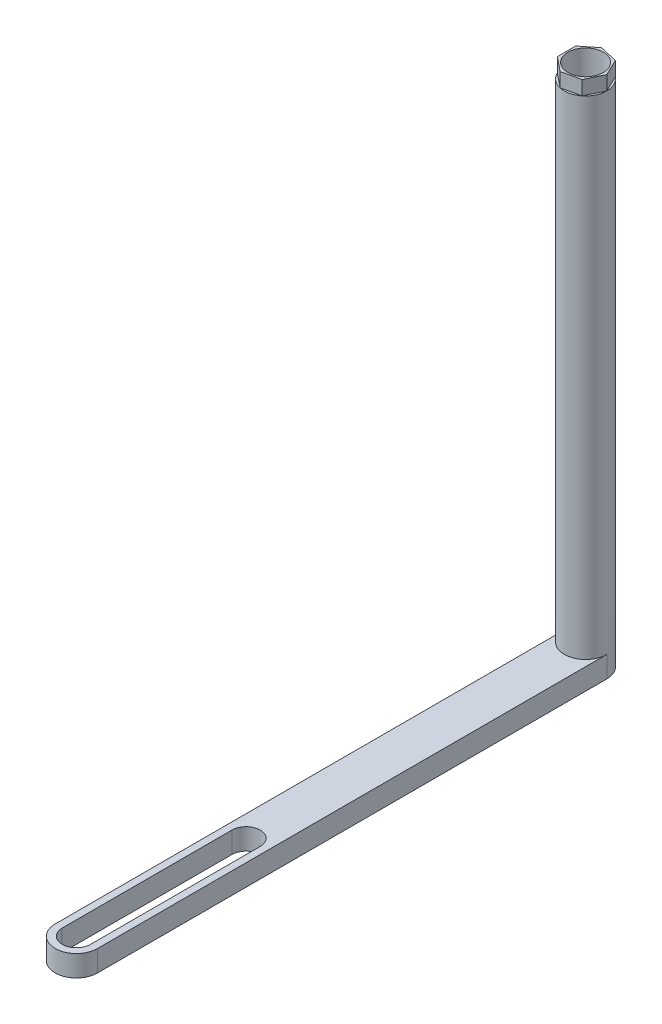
from build123d import *

# Parameters (mm, degrees)
SKETCH1_R           = 1.5
SKETCH1_R_2         = 1.25
BOSS_EXTRUDE1_DEPTH = 37
SKETCH2_R           = 1.25
BOSS_EXTRUDE2_DEPTH = 1.5
CUT_EXTRUDE1_START  = -1
CUT_EXTRUDE1_DEPTH  = 1


with BuildPart() as part:
    # Sketch1 → Boss-Extrude1 (new body)
    with BuildSketch(Plane(origin=(0, 0, 0), x_dir=(1, 0, 0), z_dir=(0, 1, 0))):
        with Locations(Location((0, 0, 0), (0, 0, 270))):
            Circle(SKETCH1_R)
        with Locations(Location((0, 0, 0), (0, 0, 270))):
            Circle(SKETCH1_R_2, mode=Mode.SUBTRACT)
    extrude(amount=BOSS_EXTRUDE1_DEPTH)

    # Sketch2 → Boss-Extrude2 (add)
    with BuildSketch(Plane.XZ):
        with BuildLine():
            Line((-1.5, 0), (-1.5, 36))
            ThreePointArc((-1.5, 36), (0, 37.5), (1.5, 36))
            Line((1.5, 36), (1.5, 0))
            ThreePointArc((1.5, 0), (0, -1.5), (-1.5, 0))
        make_face()
        with Locations(Location((0, 0, 0), (0, 0, 90))):
            Circle(SKETCH2_R, mode=Mode.SUBTRACT)
        with BuildLine():
            Line((1, 36), (1, 24))
            ThreePointArc((1, 24), (0, 23), (-1, 24))
            Line((-1, 24), (-1, 36))
            ThreePointArc((-1, 36), (0, 37), (1, 36))
        make_face(mode=Mode.SUBTRACT)
    extrude(amount=-BOSS_EXTRUDE2_DEPTH)

    # Sketch3 → Cut-Extrude1 (cut)
    with BuildSketch(Plane(origin=(0, 37, 0), x_dir=(1, 0, 0), z_dir=(0, 1, 0)).offset(CUT_EXTRUDE1_START)):
        with BuildLine():
            Line((-1.351453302, -0.650825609), (-1.351453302, 0.650825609))
            ThreePointArc((-1.351453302, 0.650825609), (-1.5, 0), (-1.351453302, -0.650825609))
        make_face()
        with BuildLine():
            Line((-1.351453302, 0.650825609), (-0.333781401, 1.462391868))
            ThreePointArc((-0.333781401, 1.462391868), (-0.935234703, 1.172747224), (-1.351453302, 0.650825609))
        make_face()
        with BuildLine():
            Line((-0.333781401, 1.462391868), (0.935234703, 1.172747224))
            ThreePointArc((0.935234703, 1.172747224), (0.333781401, 1.462391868), (-0.333781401, 1.462391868))
        make_face()
        with BuildLine():
            Line((0.935234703, 1.172747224), (1.5, 0))
            ThreePointArc((1.5, 0), (1.351453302, 0.650825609), (0.935234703, 1.172747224))
        make_face()
        with BuildLine():
            ThreePointArc((0.935234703, -1.172747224), (1.351453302, -0.650825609), (1.5, 0))
            Line((1.5, 0), (0.935234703, -1.172747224))
        make_face()
        with BuildLine():
            ThreePointArc((-0.333781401, -1.462391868), (0.333781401, -1.462391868), (0.935234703, -1.172747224))
            Line((0.935234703, -1.172747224), (-0.333781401, -1.462391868))
        make_face()
        with BuildLine():
            ThreePointArc((-1.351453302, -0.650825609), (-0.935234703, -1.172747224), (-0.333781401, -1.462391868))
            Line((-0.333781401, -1.462391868), (-1.351453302, -0.650825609))
        make_face()
    extrude(amount=CUT_EXTRUDE1_DEPTH, mode=Mode.SUBTRACT)


solid = part.part
